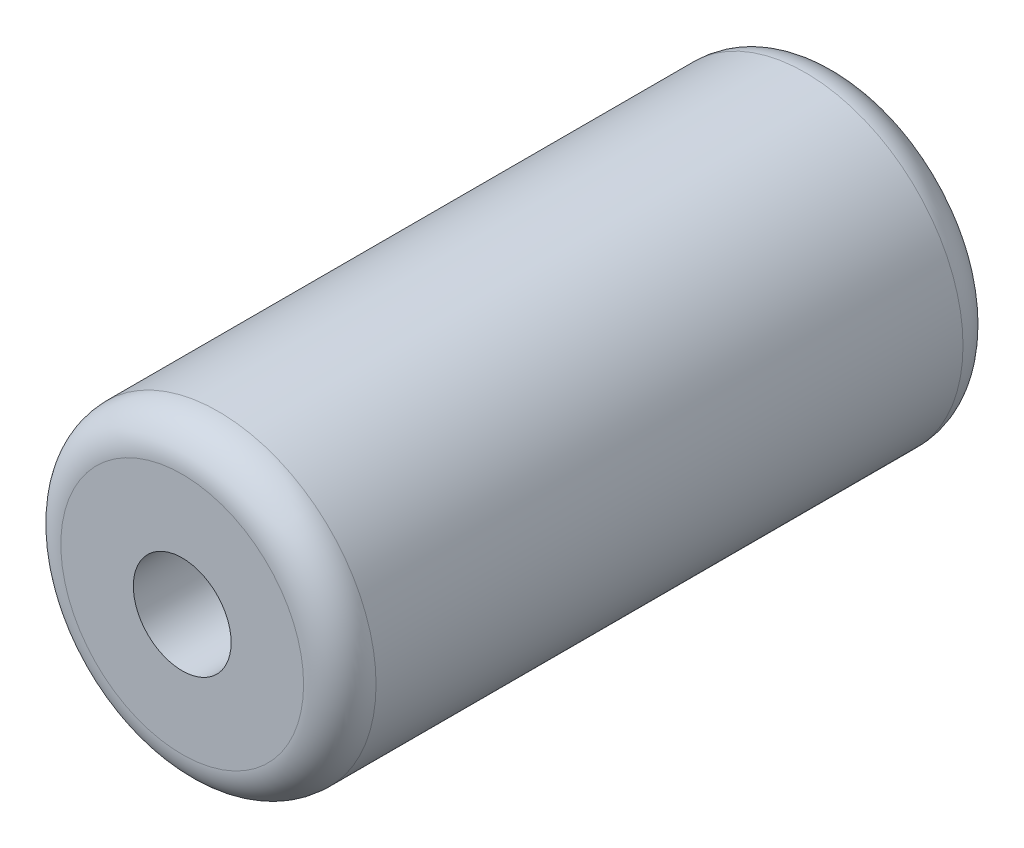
ISO-10303-21;
HEADER;
FILE_DESCRIPTION(('STEP AP214'),'2;1');
FILE_NAME('part.step','',(''),(''),'','','');
FILE_SCHEMA(('AUTOMOTIVE_DESIGN { 1 0 10303 214 1 1 1 1 }'));
ENDSEC;
DATA;
#1=APPLICATION_CONTEXT('core data for automotive mechanical design processes');
#2=APPLICATION_PROTOCOL_DEFINITION('international standard','automotive_design',2000,#1);
#3=PRODUCT_CONTEXT('',#1,'mechanical');
#4=PRODUCT('Part','Part','',(#3));
#5=PRODUCT_RELATED_PRODUCT_CATEGORY('part','',(#4));
#6=PRODUCT_DEFINITION_FORMATION('','',#4);
#7=PRODUCT_DEFINITION_CONTEXT('part definition',#1,'design');
#8=PRODUCT_DEFINITION('design','',#6,#7);
#9=PRODUCT_DEFINITION_SHAPE('','',#8);
#10=(LENGTH_UNIT() NAMED_UNIT(*) SI_UNIT(.MILLI.,.METRE.));
#11=(NAMED_UNIT(*) PLANE_ANGLE_UNIT() SI_UNIT($,.RADIAN.));
#12=(NAMED_UNIT(*) SI_UNIT($,.STERADIAN.) SOLID_ANGLE_UNIT());
#13=UNCERTAINTY_MEASURE_WITH_UNIT(LENGTH_MEASURE(1.E-05),#10,'distance_accuracy_value','');
#14=(GEOMETRIC_REPRESENTATION_CONTEXT(3) GLOBAL_UNCERTAINTY_ASSIGNED_CONTEXT((#13)) GLOBAL_UNIT_ASSIGNED_CONTEXT((#10,
#11,#12)) REPRESENTATION_CONTEXT('',''));
#15=CARTESIAN_POINT('',(0.,0.,0.));
#16=DIRECTION('',(0.,0.,1.));
#17=DIRECTION('',(1.,0.,0.));
#18=AXIS2_PLACEMENT_3D('',#15,#16,#17);
#19=CARTESIAN_POINT('',(0.,0.,182.));
#20=DIRECTION('',(0.,0.,-1.));
#21=DIRECTION('',(-1.,0.,0.));
#22=AXIS2_PLACEMENT_3D('',#19,#20,#21);
#23=CYLINDRICAL_SURFACE('',#22,43.5);
#24=CARTESIAN_POINT('',(0.,0.,10.));
#25=DIRECTION('',(0.,0.,1.));
#26=DIRECTION('',(1.,0.,0.));
#27=AXIS2_PLACEMENT_3D('',#24,#25,#26);
#28=CIRCLE('',#27,43.5);
#29=CARTESIAN_POINT('',(43.5,0.,10.));
#30=VERTEX_POINT('',#29);
#31=EDGE_CURVE('E41',#30,#30,#28,.T.);
#32=ORIENTED_EDGE('',*,*,#31,.T.);
#33=EDGE_LOOP('',(#32));
#34=FACE_BOUND('',#33,.T.);
#35=CARTESIAN_POINT('',(0.,0.,172.));
#36=DIRECTION('',(0.,0.,1.));
#37=DIRECTION('',(1.,0.,0.));
#38=AXIS2_PLACEMENT_3D('',#35,#36,#37);
#39=CIRCLE('',#38,43.5);
#40=CARTESIAN_POINT('',(43.5,0.,172.));
#41=VERTEX_POINT('',#40);
#42=EDGE_CURVE('E45',#41,#41,#39,.F.);
#43=ORIENTED_EDGE('',*,*,#42,.T.);
#44=EDGE_LOOP('',(#43));
#45=FACE_BOUND('',#44,.T.);
#46=ADVANCED_FACE('F30',(#34,#45),#23,.T.);
#47=CARTESIAN_POINT('',(0.,0.,182.));
#48=DIRECTION('',(0.,0.,1.));
#49=DIRECTION('',(1.,0.,0.));
#50=AXIS2_PLACEMENT_3D('',#47,#48,#49);
#51=PLANE('',#50);
#52=CARTESIAN_POINT('',(0.,0.,182.));
#53=DIRECTION('',(0.,0.,1.));
#54=DIRECTION('',(1.,0.,0.));
#55=AXIS2_PLACEMENT_3D('',#52,#53,#54);
#56=CIRCLE('',#55,13.5);
#57=CARTESIAN_POINT('',(13.5,0.,182.));
#58=VERTEX_POINT('',#57);
#59=EDGE_CURVE('E51',#58,#58,#56,.T.);
#60=ORIENTED_EDGE('',*,*,#59,.F.);
#61=EDGE_LOOP('',(#60));
#62=FACE_BOUND('',#61,.T.);
#63=CARTESIAN_POINT('',(0.,0.,182.));
#64=DIRECTION('',(0.,0.,1.));
#65=DIRECTION('',(1.,0.,0.));
#66=AXIS2_PLACEMENT_3D('',#63,#64,#65);
#67=CIRCLE('',#66,33.5);
#68=CARTESIAN_POINT('',(33.5,0.,182.));
#69=VERTEX_POINT('',#68);
#70=EDGE_CURVE('E10',#69,#69,#67,.T.);
#71=ORIENTED_EDGE('',*,*,#70,.T.);
#72=EDGE_LOOP('',(#71));
#73=FACE_BOUND('',#72,.T.);
#74=ADVANCED_FACE('F65',(#62,#73),#51,.T.);
#75=CARTESIAN_POINT('',(0.,0.,0.));
#76=DIRECTION('',(0.,0.,1.));
#77=DIRECTION('',(1.,0.,0.));
#78=AXIS2_PLACEMENT_3D('',#75,#76,#77);
#79=PLANE('',#78);
#80=CARTESIAN_POINT('',(0.,0.,0.));
#81=DIRECTION('',(0.,0.,1.));
#82=DIRECTION('',(1.,0.,0.));
#83=AXIS2_PLACEMENT_3D('',#80,#81,#82);
#84=CIRCLE('',#83,13.5);
#85=CARTESIAN_POINT('',(13.5,0.,0.));
#86=VERTEX_POINT('',#85);
#87=EDGE_CURVE('E50',#86,#86,#84,.T.);
#88=ORIENTED_EDGE('',*,*,#87,.T.);
#89=EDGE_LOOP('',(#88));
#90=FACE_BOUND('',#89,.T.);
#91=CARTESIAN_POINT('',(0.,0.,0.));
#92=DIRECTION('',(0.,0.,1.));
#93=DIRECTION('',(1.,0.,0.));
#94=AXIS2_PLACEMENT_3D('',#91,#92,#93);
#95=CIRCLE('',#94,33.5);
#96=CARTESIAN_POINT('',(33.5,0.,0.));
#97=VERTEX_POINT('',#96);
#98=EDGE_CURVE('E37',#97,#97,#95,.F.);
#99=ORIENTED_EDGE('',*,*,#98,.T.);
#100=EDGE_LOOP('',(#99));
#101=FACE_BOUND('',#100,.T.);
#102=ADVANCED_FACE('F57',(#90,#101),#79,.F.);
#103=CARTESIAN_POINT('',(0.,0.,10.));
#104=DIRECTION('',(0.,0.,1.));
#105=DIRECTION('',(1.,0.,0.));
#106=AXIS2_PLACEMENT_3D('',#103,#104,#105);
#107=TOROIDAL_SURFACE('',#106,33.5,10.);
#108=ORIENTED_EDGE('',*,*,#98,.F.);
#109=EDGE_LOOP('',(#108));
#110=FACE_BOUND('',#109,.T.);
#111=ORIENTED_EDGE('',*,*,#31,.F.);
#112=EDGE_LOOP('',(#111));
#113=FACE_BOUND('',#112,.T.);
#114=ADVANCED_FACE('F72',(#110,#113),#107,.T.);
#115=CARTESIAN_POINT('',(0.,0.,172.));
#116=DIRECTION('',(0.,0.,1.));
#117=DIRECTION('',(1.,0.,0.));
#118=AXIS2_PLACEMENT_3D('',#115,#116,#117);
#119=TOROIDAL_SURFACE('',#118,33.5,10.);
#120=ORIENTED_EDGE('',*,*,#42,.F.);
#121=EDGE_LOOP('',(#120));
#122=FACE_BOUND('',#121,.T.);
#123=ORIENTED_EDGE('',*,*,#70,.F.);
#124=EDGE_LOOP('',(#123));
#125=FACE_BOUND('',#124,.T.);
#126=ADVANCED_FACE('F32',(#122,#125),#119,.T.);
#127=CARTESIAN_POINT('',(0.,0.,0.));
#128=DIRECTION('',(0.,0.,1.));
#129=DIRECTION('',(1.,0.,0.));
#130=AXIS2_PLACEMENT_3D('',#127,#128,#129);
#131=CYLINDRICAL_SURFACE('',#130,13.5);
#132=ORIENTED_EDGE('',*,*,#87,.F.);
#133=EDGE_LOOP('',(#132));
#134=FACE_BOUND('',#133,.T.);
#135=ORIENTED_EDGE('',*,*,#59,.T.);
#136=EDGE_LOOP('',(#135));
#137=FACE_BOUND('',#136,.T.);
#138=ADVANCED_FACE('F59',(#134,#137),#131,.F.);
#139=CLOSED_SHELL('',(#46,#74,#102,#114,#126,#138));
#140=MANIFOLD_SOLID_BREP('B2',#139);
#141=ADVANCED_BREP_SHAPE_REPRESENTATION('',(#18,#140),#14);
#142=SHAPE_DEFINITION_REPRESENTATION(#9,#141);
ENDSEC;
END-ISO-10303-21;
